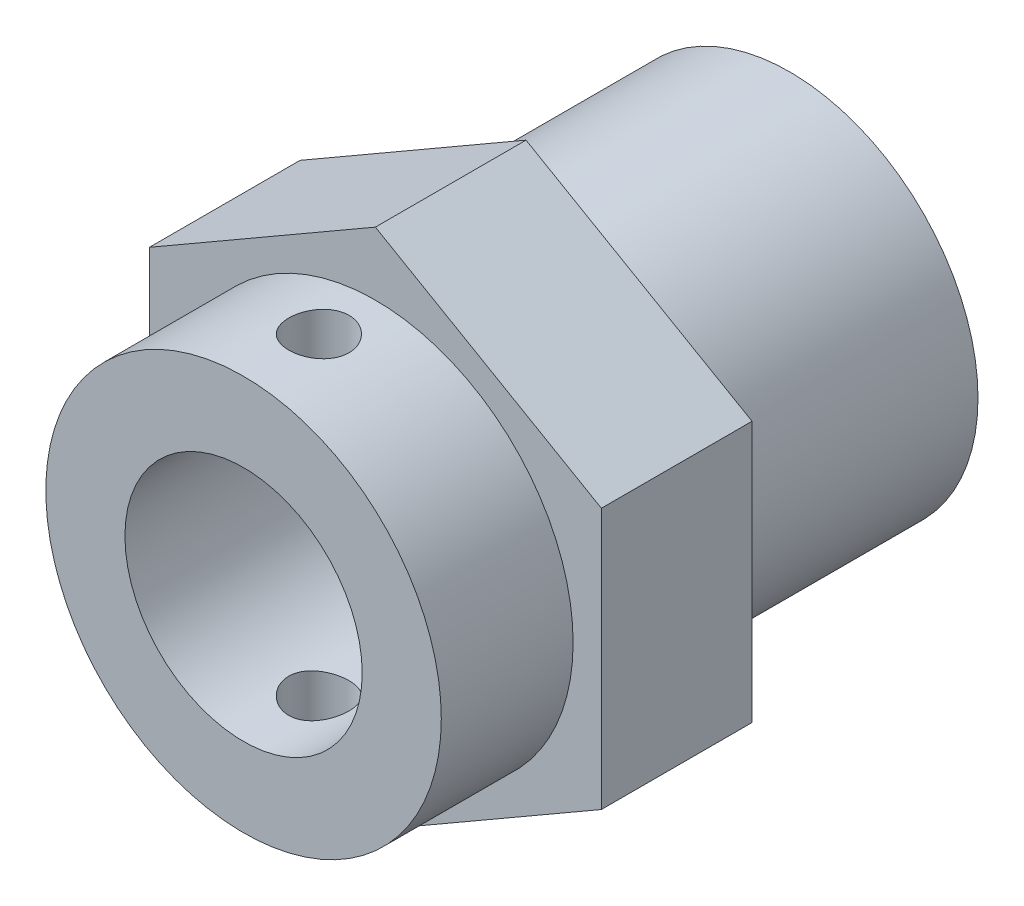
ISO-10303-21;
HEADER;
FILE_DESCRIPTION(('STEP AP214'),'2;1');
FILE_NAME('part.step','',(''),(''),'','','');
FILE_SCHEMA(('AUTOMOTIVE_DESIGN { 1 0 10303 214 1 1 1 1 }'));
ENDSEC;
DATA;
#1=APPLICATION_CONTEXT('core data for automotive mechanical design processes');
#2=APPLICATION_PROTOCOL_DEFINITION('international standard','automotive_design',2000,#1);
#3=PRODUCT_CONTEXT('',#1,'mechanical');
#4=PRODUCT('Part','Part','',(#3));
#5=PRODUCT_RELATED_PRODUCT_CATEGORY('part','',(#4));
#6=PRODUCT_DEFINITION_FORMATION('','',#4);
#7=PRODUCT_DEFINITION_CONTEXT('part definition',#1,'design');
#8=PRODUCT_DEFINITION('design','',#6,#7);
#9=PRODUCT_DEFINITION_SHAPE('','',#8);
#10=(LENGTH_UNIT() NAMED_UNIT(*) SI_UNIT(.MILLI.,.METRE.));
#11=(NAMED_UNIT(*) PLANE_ANGLE_UNIT() SI_UNIT($,.RADIAN.));
#12=(NAMED_UNIT(*) SI_UNIT($,.STERADIAN.) SOLID_ANGLE_UNIT());
#13=UNCERTAINTY_MEASURE_WITH_UNIT(LENGTH_MEASURE(1.E-05),#10,'distance_accuracy_value','');
#14=(GEOMETRIC_REPRESENTATION_CONTEXT(3) GLOBAL_UNCERTAINTY_ASSIGNED_CONTEXT((#13)) GLOBAL_UNIT_ASSIGNED_CONTEXT((#10,
#11,#12)) REPRESENTATION_CONTEXT('',''));
#15=CARTESIAN_POINT('',(0.,0.,0.));
#16=DIRECTION('',(0.,0.,1.));
#17=DIRECTION('',(1.,0.,0.));
#18=AXIS2_PLACEMENT_3D('',#15,#16,#17);
#19=CARTESIAN_POINT('',(0.,0.,3.));
#20=DIRECTION('',(0.,0.,-1.));
#21=DIRECTION('',(-1.,0.,0.));
#22=AXIS2_PLACEMENT_3D('',#19,#20,#21);
#23=CYLINDRICAL_SURFACE('',#22,3.15);
#24=CARTESIAN_POINT('',(0.,0.,3.));
#25=DIRECTION('',(0.,0.,-1.));
#26=DIRECTION('',(-1.,0.,0.));
#27=AXIS2_PLACEMENT_3D('',#24,#25,#26);
#28=CIRCLE('',#27,3.15);
#29=CARTESIAN_POINT('',(-3.15,0.,3.));
#30=VERTEX_POINT('',#29);
#31=EDGE_CURVE('E11',#30,#30,#28,.T.);
#32=ORIENTED_EDGE('',*,*,#31,.T.);
#33=EDGE_LOOP('',(#32));
#34=FACE_BOUND('',#33,.T.);
#35=CARTESIAN_POINT('',(0.,0.,-7.));
#36=DIRECTION('',(0.,0.,-1.));
#37=DIRECTION('',(-1.,0.,0.));
#38=AXIS2_PLACEMENT_3D('',#35,#36,#37);
#39=CIRCLE('',#38,3.15);
#40=CARTESIAN_POINT('',(-3.15,0.,-7.));
#41=VERTEX_POINT('',#40);
#42=EDGE_CURVE('E49',#41,#41,#39,.T.);
#43=ORIENTED_EDGE('',*,*,#42,.F.);
#44=EDGE_LOOP('',(#43));
#45=FACE_BOUND('',#44,.T.);
#46=ADVANCED_FACE('F46',(#34,#45),#23,.T.);
#47=CARTESIAN_POINT('',(0.,0.,3.));
#48=DIRECTION('',(0.,0.,-1.));
#49=DIRECTION('',(-1.,0.,0.));
#50=AXIS2_PLACEMENT_3D('',#47,#48,#49);
#51=PLANE('',#50);
#52=ORIENTED_EDGE('',*,*,#31,.F.);
#53=EDGE_LOOP('',(#52));
#54=FACE_BOUND('',#53,.T.);
#55=ADVANCED_FACE('F61',(#54),#51,.F.);
#56=CARTESIAN_POINT('',(0.,0.,-7.));
#57=DIRECTION('',(0.,0.,-1.));
#58=DIRECTION('',(-1.,0.,0.));
#59=AXIS2_PLACEMENT_3D('',#56,#57,#58);
#60=PLANE('',#59);
#61=ORIENTED_EDGE('',*,*,#42,.T.);
#62=EDGE_LOOP('',(#61));
#63=FACE_BOUND('',#62,.T.);
#64=ADVANCED_FACE('F58',(#63),#60,.T.);
#65=CLOSED_SHELL('',(#46,#55,#64));
#66=MANIFOLD_SOLID_BREP('B2',#65);
#67=CARTESIAN_POINT('',(0.,0.,4.));
#68=DIRECTION('',(0.,0.,1.));
#69=DIRECTION('',(1.,0.,0.));
#70=AXIS2_PLACEMENT_3D('',#67,#68,#69);
#71=PLANE('',#70);
#72=DIRECTION('',(0.,1.,0.));
#73=VECTOR('',#72,1.);
#74=CARTESIAN_POINT('',(6.,-3.46410161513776,4.));
#75=LINE('',#74,#73);
#76=CARTESIAN_POINT('',(6.,-3.46410161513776,4.));
#77=VERTEX_POINT('',#76);
#78=CARTESIAN_POINT('',(6.,3.46410161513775,4.));
#79=VERTEX_POINT('',#78);
#80=EDGE_CURVE('E189',#77,#79,#75,.T.);
#81=ORIENTED_EDGE('',*,*,#80,.T.);
#82=DIRECTION('',(-0.866025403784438,0.5,0.));
#83=VECTOR('',#82,1.);
#84=CARTESIAN_POINT('',(6.,3.46410161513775,4.));
#85=LINE('',#84,#83);
#86=CARTESIAN_POINT('',(0.,6.92820323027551,4.));
#87=VERTEX_POINT('',#86);
#88=EDGE_CURVE('E147',#79,#87,#85,.T.);
#89=ORIENTED_EDGE('',*,*,#88,.T.);
#90=DIRECTION('',(-0.866025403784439,-0.5,0.));
#91=VECTOR('',#90,1.);
#92=CARTESIAN_POINT('',(0.,6.92820323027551,4.));
#93=LINE('',#92,#91);
#94=CARTESIAN_POINT('',(-6.,3.46410161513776,4.));
#95=VERTEX_POINT('',#94);
#96=EDGE_CURVE('E160',#87,#95,#93,.T.);
#97=ORIENTED_EDGE('',*,*,#96,.T.);
#98=DIRECTION('',(0.,-1.,0.));
#99=VECTOR('',#98,1.);
#100=CARTESIAN_POINT('',(-6.,3.46410161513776,4.));
#101=LINE('',#100,#99);
#102=CARTESIAN_POINT('',(-6.,-3.46410161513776,4.));
#103=VERTEX_POINT('',#102);
#104=EDGE_CURVE('E154',#95,#103,#101,.T.);
#105=ORIENTED_EDGE('',*,*,#104,.T.);
#106=DIRECTION('',(0.866025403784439,-0.5,0.));
#107=VECTOR('',#106,1.);
#108=CARTESIAN_POINT('',(-6.,-3.46410161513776,4.));
#109=LINE('',#108,#107);
#110=CARTESIAN_POINT('',(0.,-6.92820323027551,4.));
#111=VERTEX_POINT('',#110);
#112=EDGE_CURVE('E158',#103,#111,#109,.T.);
#113=ORIENTED_EDGE('',*,*,#112,.T.);
#114=DIRECTION('',(0.866025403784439,0.5,0.));
#115=VECTOR('',#114,1.);
#116=CARTESIAN_POINT('',(0.,-6.92820323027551,4.));
#117=LINE('',#116,#115);
#118=EDGE_CURVE('E109',#111,#77,#117,.T.);
#119=ORIENTED_EDGE('',*,*,#118,.T.);
#120=EDGE_LOOP('',(#81,#89,#97,#105,#113,#119));
#121=FACE_BOUND('',#120,.T.);
#122=CARTESIAN_POINT('',(0.,0.,4.));
#123=DIRECTION('',(0.,0.,1.));
#124=DIRECTION('',(1.,0.,0.));
#125=AXIS2_PLACEMENT_3D('',#122,#123,#124);
#126=CIRCLE('',#125,5.25);
#127=CARTESIAN_POINT('',(5.25,0.,4.));
#128=VERTEX_POINT('',#127);
#129=EDGE_CURVE('E277',#128,#128,#126,.T.);
#130=ORIENTED_EDGE('',*,*,#129,.F.);
#131=EDGE_LOOP('',(#130));
#132=FACE_BOUND('',#131,.T.);
#133=ADVANCED_FACE('F86',(#121,#132),#71,.T.);
#134=CARTESIAN_POINT('',(0.,0.,-7.));
#135=DIRECTION('',(0.,0.,1.));
#136=DIRECTION('',(1.,0.,0.));
#137=AXIS2_PLACEMENT_3D('',#134,#135,#136);
#138=CYLINDRICAL_SURFACE('',#137,5.);
#139=CARTESIAN_POINT('',(0.,0.,-7.));
#140=DIRECTION('',(0.,0.,1.));
#141=DIRECTION('',(1.,0.,0.));
#142=AXIS2_PLACEMENT_3D('',#139,#140,#141);
#143=CIRCLE('',#142,5.);
#144=CARTESIAN_POINT('',(5.,0.,-7.));
#145=VERTEX_POINT('',#144);
#146=EDGE_CURVE('E44',#145,#145,#143,.T.);
#147=ORIENTED_EDGE('',*,*,#146,.T.);
#148=EDGE_LOOP('',(#147));
#149=FACE_BOUND('',#148,.T.);
#150=CARTESIAN_POINT('',(0.,0.,0.));
#151=DIRECTION('',(0.,0.,1.));
#152=DIRECTION('',(1.,0.,0.));
#153=AXIS2_PLACEMENT_3D('',#150,#151,#152);
#154=CIRCLE('',#153,5.);
#155=CARTESIAN_POINT('',(5.,0.,0.));
#156=VERTEX_POINT('',#155);
#157=EDGE_CURVE('E100',#156,#156,#154,.T.);
#158=ORIENTED_EDGE('',*,*,#157,.F.);
#159=EDGE_LOOP('',(#158));
#160=FACE_BOUND('',#159,.T.);
#161=ADVANCED_FACE('F88',(#149,#160),#138,.T.);
#162=CARTESIAN_POINT('',(0.,0.,-7.));
#163=DIRECTION('',(0.,0.,1.));
#164=DIRECTION('',(1.,0.,0.));
#165=AXIS2_PLACEMENT_3D('',#162,#163,#164);
#166=PLANE('',#165);
#167=CARTESIAN_POINT('',(0.,0.,-7.));
#168=DIRECTION('',(0.,0.,1.));
#169=DIRECTION('',(1.,0.,0.));
#170=AXIS2_PLACEMENT_3D('',#167,#168,#169);
#171=CIRCLE('',#170,3.15);
#172=CARTESIAN_POINT('',(3.15,0.,-7.));
#173=VERTEX_POINT('',#172);
#174=EDGE_CURVE('E265',#173,#173,#171,.T.);
#175=ORIENTED_EDGE('',*,*,#174,.T.);
#176=EDGE_LOOP('',(#175));
#177=FACE_BOUND('',#176,.T.);
#178=ORIENTED_EDGE('',*,*,#146,.F.);
#179=EDGE_LOOP('',(#178));
#180=FACE_BOUND('',#179,.T.);
#181=ADVANCED_FACE('F254',(#177,#180),#166,.F.);
#182=CARTESIAN_POINT('',(6.,-3.46410161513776,4.));
#183=DIRECTION('',(-1.,0.,0.));
#184=DIRECTION('',(0.,-1.,0.));
#185=AXIS2_PLACEMENT_3D('',#182,#183,#184);
#186=PLANE('',#185);
#187=DIRECTION('',(0.,1.,0.));
#188=VECTOR('',#187,1.);
#189=CARTESIAN_POINT('',(6.,-3.46410161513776,0.));
#190=LINE('',#189,#188);
#191=CARTESIAN_POINT('',(6.,-3.46410161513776,0.));
#192=VERTEX_POINT('',#191);
#193=CARTESIAN_POINT('',(6.,3.46410161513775,0.));
#194=VERTEX_POINT('',#193);
#195=EDGE_CURVE('E178',#192,#194,#190,.T.);
#196=ORIENTED_EDGE('',*,*,#195,.T.);
#197=DIRECTION('',(0.,0.,-1.));
#198=VECTOR('',#197,1.);
#199=CARTESIAN_POINT('',(6.,3.46410161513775,4.));
#200=LINE('',#199,#198);
#201=EDGE_CURVE('E196',#79,#194,#200,.T.);
#202=ORIENTED_EDGE('',*,*,#201,.F.);
#203=ORIENTED_EDGE('',*,*,#80,.F.);
#204=DIRECTION('',(0.,0.,-1.));
#205=VECTOR('',#204,1.);
#206=CARTESIAN_POINT('',(6.,-3.46410161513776,4.));
#207=LINE('',#206,#205);
#208=EDGE_CURVE('E174',#77,#192,#207,.T.);
#209=ORIENTED_EDGE('',*,*,#208,.T.);
#210=EDGE_LOOP('',(#196,#202,#203,#209));
#211=FACE_BOUND('',#210,.T.);
#212=ADVANCED_FACE('F252',(#211),#186,.F.);
#213=CARTESIAN_POINT('',(6.,3.46410161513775,4.));
#214=DIRECTION('',(-0.5,-0.866025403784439,0.));
#215=DIRECTION('',(0.866025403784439,-0.5,0.));
#216=AXIS2_PLACEMENT_3D('',#213,#214,#215);
#217=PLANE('',#216);
#218=DIRECTION('',(-0.866025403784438,0.5,0.));
#219=VECTOR('',#218,1.);
#220=CARTESIAN_POINT('',(6.,3.46410161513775,0.));
#221=LINE('',#220,#219);
#222=CARTESIAN_POINT('',(0.,6.92820323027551,0.));
#223=VERTEX_POINT('',#222);
#224=EDGE_CURVE('E181',#194,#223,#221,.T.);
#225=ORIENTED_EDGE('',*,*,#224,.T.);
#226=DIRECTION('',(0.,0.,-1.));
#227=VECTOR('',#226,1.);
#228=CARTESIAN_POINT('',(0.,6.92820323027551,4.));
#229=LINE('',#228,#227);
#230=EDGE_CURVE('E193',#87,#223,#229,.T.);
#231=ORIENTED_EDGE('',*,*,#230,.F.);
#232=ORIENTED_EDGE('',*,*,#88,.F.);
#233=ORIENTED_EDGE('',*,*,#201,.T.);
#234=EDGE_LOOP('',(#225,#231,#232,#233));
#235=FACE_BOUND('',#234,.T.);
#236=ADVANCED_FACE('F248',(#235),#217,.F.);
#237=CARTESIAN_POINT('',(0.,6.92820323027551,4.));
#238=DIRECTION('',(0.5,-0.866025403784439,0.));
#239=DIRECTION('',(0.866025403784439,0.5,0.));
#240=AXIS2_PLACEMENT_3D('',#237,#238,#239);
#241=PLANE('',#240);
#242=DIRECTION('',(-0.866025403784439,-0.5,0.));
#243=VECTOR('',#242,1.);
#244=CARTESIAN_POINT('',(0.,6.92820323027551,0.));
#245=LINE('',#244,#243);
#246=CARTESIAN_POINT('',(-6.,3.46410161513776,0.));
#247=VERTEX_POINT('',#246);
#248=EDGE_CURVE('E184',#223,#247,#245,.T.);
#249=ORIENTED_EDGE('',*,*,#248,.T.);
#250=DIRECTION('',(0.,0.,-1.));
#251=VECTOR('',#250,1.);
#252=CARTESIAN_POINT('',(-6.,3.46410161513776,4.));
#253=LINE('',#252,#251);
#254=EDGE_CURVE('E169',#95,#247,#253,.T.);
#255=ORIENTED_EDGE('',*,*,#254,.F.);
#256=ORIENTED_EDGE('',*,*,#96,.F.);
#257=ORIENTED_EDGE('',*,*,#230,.T.);
#258=EDGE_LOOP('',(#249,#255,#256,#257));
#259=FACE_BOUND('',#258,.T.);
#260=ADVANCED_FACE('F245',(#259),#241,.F.);
#261=CARTESIAN_POINT('',(-6.,3.46410161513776,4.));
#262=DIRECTION('',(1.,0.,0.));
#263=DIRECTION('',(0.,0.,-1.));
#264=AXIS2_PLACEMENT_3D('',#261,#262,#263);
#265=PLANE('',#264);
#266=DIRECTION('',(0.,-1.,0.));
#267=VECTOR('',#266,1.);
#268=CARTESIAN_POINT('',(-6.,3.46410161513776,0.));
#269=LINE('',#268,#267);
#270=CARTESIAN_POINT('',(-6.,-3.46410161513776,0.));
#271=VERTEX_POINT('',#270);
#272=EDGE_CURVE('E168',#247,#271,#269,.T.);
#273=ORIENTED_EDGE('',*,*,#272,.T.);
#274=DIRECTION('',(0.,0.,-1.));
#275=VECTOR('',#274,1.);
#276=CARTESIAN_POINT('',(-6.,-3.46410161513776,4.));
#277=LINE('',#276,#275);
#278=EDGE_CURVE('E165',#103,#271,#277,.T.);
#279=ORIENTED_EDGE('',*,*,#278,.F.);
#280=ORIENTED_EDGE('',*,*,#104,.F.);
#281=ORIENTED_EDGE('',*,*,#254,.T.);
#282=EDGE_LOOP('',(#273,#279,#280,#281));
#283=FACE_BOUND('',#282,.T.);
#284=ADVANCED_FACE('F166',(#283),#265,.F.);
#285=CARTESIAN_POINT('',(-6.,-3.46410161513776,4.));
#286=DIRECTION('',(0.5,0.866025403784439,0.));
#287=DIRECTION('',(-0.866025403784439,0.5,0.));
#288=AXIS2_PLACEMENT_3D('',#285,#286,#287);
#289=PLANE('',#288);
#290=DIRECTION('',(0.866025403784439,-0.5,0.));
#291=VECTOR('',#290,1.);
#292=CARTESIAN_POINT('',(-6.,-3.46410161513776,0.));
#293=LINE('',#292,#291);
#294=CARTESIAN_POINT('',(0.,-6.92820323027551,0.));
#295=VERTEX_POINT('',#294);
#296=EDGE_CURVE('E132',#271,#295,#293,.T.);
#297=ORIENTED_EDGE('',*,*,#296,.T.);
#298=DIRECTION('',(0.,0.,-1.));
#299=VECTOR('',#298,1.);
#300=CARTESIAN_POINT('',(0.,-6.92820323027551,4.));
#301=LINE('',#300,#299);
#302=EDGE_CURVE('E170',#111,#295,#301,.T.);
#303=ORIENTED_EDGE('',*,*,#302,.F.);
#304=ORIENTED_EDGE('',*,*,#112,.F.);
#305=ORIENTED_EDGE('',*,*,#278,.T.);
#306=EDGE_LOOP('',(#297,#303,#304,#305));
#307=FACE_BOUND('',#306,.T.);
#308=ADVANCED_FACE('F172',(#307),#289,.F.);
#309=CARTESIAN_POINT('',(0.,-6.92820323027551,4.));
#310=DIRECTION('',(-0.5,0.866025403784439,0.));
#311=DIRECTION('',(-0.866025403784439,-0.5,0.));
#312=AXIS2_PLACEMENT_3D('',#309,#310,#311);
#313=PLANE('',#312);
#314=DIRECTION('',(0.866025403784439,0.5,0.));
#315=VECTOR('',#314,1.);
#316=CARTESIAN_POINT('',(0.,-6.92820323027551,0.));
#317=LINE('',#316,#315);
#318=EDGE_CURVE('E138',#295,#192,#317,.T.);
#319=ORIENTED_EDGE('',*,*,#318,.T.);
#320=ORIENTED_EDGE('',*,*,#208,.F.);
#321=ORIENTED_EDGE('',*,*,#118,.F.);
#322=ORIENTED_EDGE('',*,*,#302,.T.);
#323=EDGE_LOOP('',(#319,#320,#321,#322));
#324=FACE_BOUND('',#323,.T.);
#325=ADVANCED_FACE('F237',(#324),#313,.F.);
#326=CARTESIAN_POINT('',(0.,0.,0.));
#327=DIRECTION('',(0.,0.,1.));
#328=DIRECTION('',(1.,0.,0.));
#329=AXIS2_PLACEMENT_3D('',#326,#327,#328);
#330=PLANE('',#329);
#331=ORIENTED_EDGE('',*,*,#157,.T.);
#332=EDGE_LOOP('',(#331));
#333=FACE_BOUND('',#332,.T.);
#334=ORIENTED_EDGE('',*,*,#195,.F.);
#335=ORIENTED_EDGE('',*,*,#318,.F.);
#336=ORIENTED_EDGE('',*,*,#296,.F.);
#337=ORIENTED_EDGE('',*,*,#272,.F.);
#338=ORIENTED_EDGE('',*,*,#248,.F.);
#339=ORIENTED_EDGE('',*,*,#224,.F.);
#340=EDGE_LOOP('',(#334,#335,#336,#337,#338,#339));
#341=FACE_BOUND('',#340,.T.);
#342=ADVANCED_FACE('F230',(#333,#341),#330,.F.);
#343=CARTESIAN_POINT('',(0.,0.,7.5));
#344=DIRECTION('',(0.,0.,-1.));
#345=DIRECTION('',(-1.,0.,0.));
#346=AXIS2_PLACEMENT_3D('',#343,#344,#345);
#347=CYLINDRICAL_SURFACE('',#346,5.25);
#348=CARTESIAN_POINT('',(0.,-5.25,6.3));
#349=CARTESIAN_POINT('',(0.0446589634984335,-5.24999927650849,6.29999816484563));
#350=CARTESIAN_POINT('',(0.0893436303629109,-5.24942419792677,6.29624783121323));
#351=CARTESIAN_POINT('',(0.177463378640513,-5.24718544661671,6.28134971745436));
#352=CARTESIAN_POINT('',(0.220897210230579,-5.2455207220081,6.27019478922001));
#353=CARTESIAN_POINT('',(0.305227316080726,-5.2412897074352,6.24082903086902));
#354=CARTESIAN_POINT('',(0.346125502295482,-5.2387241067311,6.22262359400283));
#355=CARTESIAN_POINT('',(0.424280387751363,-5.23297464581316,6.17968691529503));
#356=CARTESIAN_POINT('',(0.461537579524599,-5.22979086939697,6.15495655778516));
#357=CARTESIAN_POINT('',(0.531658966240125,-5.22313028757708,6.09945992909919));
#358=CARTESIAN_POINT('',(0.564489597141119,-5.21965153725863,6.06865147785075));
#359=CARTESIAN_POINT('',(0.624536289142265,-5.21280826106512,6.00196397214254));
#360=CARTESIAN_POINT('',(0.651752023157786,-5.20944374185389,5.96608462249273));
#361=CARTESIAN_POINT('',(0.699927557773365,-5.2031910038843,5.8900475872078));
#362=CARTESIAN_POINT('',(0.720854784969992,-5.20030529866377,5.84986903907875));
#363=CARTESIAN_POINT('',(0.755651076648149,-5.19536353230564,5.76651593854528));
#364=CARTESIAN_POINT('',(0.769520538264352,-5.19330742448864,5.72334155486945));
#365=CARTESIAN_POINT('',(0.789703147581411,-5.19027680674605,5.63557573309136));
#366=CARTESIAN_POINT('',(0.7960738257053,-5.18929406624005,5.59099781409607));
#367=CARTESIAN_POINT('',(0.801256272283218,-5.18849647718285,5.50139568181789));
#368=CARTESIAN_POINT('',(0.800068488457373,-5.18868155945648,5.4563714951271));
#369=CARTESIAN_POINT('',(0.790214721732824,-5.19019117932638,5.36756188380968));
#370=CARTESIAN_POINT('',(0.781612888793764,-5.19150594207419,5.32376915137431));
#371=CARTESIAN_POINT('',(0.757275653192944,-5.19511150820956,5.2382559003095));
#372=CARTESIAN_POINT('',(0.741540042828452,-5.19740234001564,5.19653544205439));
#373=CARTESIAN_POINT('',(0.703315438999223,-5.20271268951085,5.11615627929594));
#374=CARTESIAN_POINT('',(0.68079934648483,-5.20573512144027,5.07751066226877));
#375=CARTESIAN_POINT('',(0.629672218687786,-5.21216602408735,5.0045218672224));
#376=CARTESIAN_POINT('',(0.601060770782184,-5.21557452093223,4.97017898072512));
#377=CARTESIAN_POINT('',(0.538203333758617,-5.22243665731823,4.90639878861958));
#378=CARTESIAN_POINT('',(0.503902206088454,-5.2258903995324,4.87701580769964));
#379=CARTESIAN_POINT('',(0.430826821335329,-5.23242120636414,4.82441511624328));
#380=CARTESIAN_POINT('',(0.392052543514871,-5.2354982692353,4.80119743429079));
#381=CARTESIAN_POINT('',(0.311083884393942,-5.24093238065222,4.76158331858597));
#382=CARTESIAN_POINT('',(0.26888737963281,-5.2432889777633,4.74519115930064));
#383=CARTESIAN_POINT('',(0.182296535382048,-5.24701288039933,4.71974106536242));
#384=CARTESIAN_POINT('',(0.137902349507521,-5.24838025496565,4.71068261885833));
#385=CARTESIAN_POINT('',(0.0486451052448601,-5.24996248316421,4.70022951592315));
#386=CARTESIAN_POINT('',(0.00379098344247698,-5.25018856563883,4.6987601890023));
#387=CARTESIAN_POINT('',(-0.0855230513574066,-5.24949332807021,4.70332871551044));
#388=CARTESIAN_POINT('',(-0.129982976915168,-5.24857204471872,4.70936632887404));
#389=CARTESIAN_POINT('',(-0.217019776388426,-5.24569253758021,4.72871525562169));
#390=CARTESIAN_POINT('',(-0.259604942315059,-5.24373951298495,4.74199010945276));
#391=CARTESIAN_POINT('',(-0.341945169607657,-5.2390147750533,4.77539818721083));
#392=CARTESIAN_POINT('',(-0.381700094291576,-5.23624302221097,4.79553174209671));
#393=CARTESIAN_POINT('',(-0.457579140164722,-5.23016087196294,4.84226031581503));
#394=CARTESIAN_POINT('',(-0.493673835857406,-5.22684659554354,4.86890260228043));
#395=CARTESIAN_POINT('',(-0.560906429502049,-5.22006014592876,4.9278266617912));
#396=CARTESIAN_POINT('',(-0.592044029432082,-5.21658796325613,4.96010877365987));
#397=CARTESIAN_POINT('',(-0.648750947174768,-5.20984133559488,5.02972887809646));
#398=CARTESIAN_POINT('',(-0.674270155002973,-5.2065688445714,5.06710790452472));
#399=CARTESIAN_POINT('',(-0.718667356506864,-5.20062698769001,5.1456658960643));
#400=CARTESIAN_POINT('',(-0.737545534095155,-5.19795760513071,5.18684475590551));
#401=CARTESIAN_POINT('',(-0.768047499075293,-5.19353841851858,5.2716853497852));
#402=CARTESIAN_POINT('',(-0.779697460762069,-5.19178530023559,5.31533749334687));
#403=CARTESIAN_POINT('',(-0.795495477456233,-5.18938839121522,5.4040075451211));
#404=CARTESIAN_POINT('',(-0.799644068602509,-5.18874452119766,5.4490253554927));
#405=CARTESIAN_POINT('',(-0.800308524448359,-5.18864203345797,5.53864926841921));
#406=CARTESIAN_POINT('',(-0.796903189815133,-5.1891711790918,5.58325479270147));
#407=CARTESIAN_POINT('',(-0.782725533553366,-5.19132847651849,5.67125079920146));
#408=CARTESIAN_POINT('',(-0.771953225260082,-5.192956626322,5.71464128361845));
#409=CARTESIAN_POINT('',(-0.743375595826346,-5.19712415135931,5.79895249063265));
#410=CARTESIAN_POINT('',(-0.725575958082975,-5.1996627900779,5.8398751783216));
#411=CARTESIAN_POINT('',(-0.683456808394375,-5.2053661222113,5.9181661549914));
#412=CARTESIAN_POINT('',(-0.659137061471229,-5.20853083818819,5.95553431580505));
#413=CARTESIAN_POINT('',(-0.604382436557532,-5.21516900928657,6.02605555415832));
#414=CARTESIAN_POINT('',(-0.573889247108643,-5.21864521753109,6.05916310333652));
#415=CARTESIAN_POINT('',(-0.507776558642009,-5.22549184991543,6.11981912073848));
#416=CARTESIAN_POINT('',(-0.472155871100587,-5.22886224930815,6.1473662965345));
#417=CARTESIAN_POINT('',(-0.396560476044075,-5.23513946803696,6.19626013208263));
#418=CARTESIAN_POINT('',(-0.356562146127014,-5.23804354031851,6.21757061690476));
#419=CARTESIAN_POINT('',(-0.273528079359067,-5.24303399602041,6.25313884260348));
#420=CARTESIAN_POINT('',(-0.230495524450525,-5.2451212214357,6.26740384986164));
#421=CARTESIAN_POINT('',(-0.156061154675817,-5.24776922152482,6.28525905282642));
#422=CARTESIAN_POINT('',(-0.125117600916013,-5.24860144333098,6.29077840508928));
#423=CARTESIAN_POINT('',(-0.062786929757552,-5.24971708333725,6.29814949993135));
#424=CARTESIAN_POINT('',(-0.0313998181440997,-5.25000050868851,6.30000129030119));
#425=CARTESIAN_POINT('',(0.,-5.25,6.3));
#426=B_SPLINE_CURVE_WITH_KNOTS('',3,(#348,#349,#350,#351,#352,#353,#354,#355,#356,#357,#358,
#359,#360,#361,#362,#363,#364,#365,#366,#367,#368,#369,#370,#371,#372,#373,#374,#375,#376,#377,
#378,#379,#380,#381,#382,#383,#384,#385,#386,#387,#388,#389,#390,#391,#392,#393,#394,#395,#396,
#397,#398,#399,#400,#401,#402,#403,#404,#405,#406,#407,#408,#409,#410,#411,#412,#413,#414,#415,
#416,#417,#418,#419,#420,#421,#422,#423,#424,#425),.UNSPECIFIED.,.T.,.F.,(4,2,2,2,2,2,2,2,2,2,2,
2,2,2,2,2,2,2,2,2,2,2,2,2,2,2,2,2,2,2,2,2,2,2,2,2,2,2,4),(0.,0.133862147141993,
0.267853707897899,0.401742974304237,0.535614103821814,0.67044918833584,0.805292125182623,
0.940821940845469,1.07634412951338,1.21081967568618,1.34528725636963,1.4786029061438,
1.61192243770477,1.74578203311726,1.87965069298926,2.0149018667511,2.15015366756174,
2.28549004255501,2.420816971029,2.55480982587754,2.68879839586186,2.82211811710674,
2.95544427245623,3.08976905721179,3.22410191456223,3.35958826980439,3.49507087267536,
3.63005996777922,3.76503941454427,3.89861741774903,4.03219517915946,4.1656651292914,
4.29913989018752,4.43393972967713,4.56877086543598,4.70436923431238,4.83982745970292,
4.93394746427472,5.02806624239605),.UNSPECIFIED.);
#427=CARTESIAN_POINT('',(0.,-5.25,6.3));
#428=VERTEX_POINT('',#427);
#429=EDGE_CURVE('E216',#428,#428,#426,.T.);
#430=ORIENTED_EDGE('',*,*,#429,.T.);
#431=EDGE_LOOP('',(#430));
#432=FACE_BOUND('',#431,.T.);
#433=CARTESIAN_POINT('',(0.,5.25,6.3));
#434=CARTESIAN_POINT('',(-0.0446589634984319,5.24999927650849,6.29999816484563));
#435=CARTESIAN_POINT('',(-0.0893436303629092,5.24942419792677,6.29624783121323));
#436=CARTESIAN_POINT('',(-0.177463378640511,5.24718544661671,6.28134971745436));
#437=CARTESIAN_POINT('',(-0.220897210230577,5.2455207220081,6.27019478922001));
#438=CARTESIAN_POINT('',(-0.305227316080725,5.2412897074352,6.24082903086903));
#439=CARTESIAN_POINT('',(-0.346125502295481,5.2387241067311,6.22262359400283));
#440=CARTESIAN_POINT('',(-0.424280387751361,5.23297464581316,6.17968691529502));
#441=CARTESIAN_POINT('',(-0.461537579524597,5.22979086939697,6.15495655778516));
#442=CARTESIAN_POINT('',(-0.531658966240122,5.22313028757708,6.09945992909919));
#443=CARTESIAN_POINT('',(-0.564489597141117,5.21965153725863,6.06865147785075));
#444=CARTESIAN_POINT('',(-0.624536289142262,5.21280826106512,6.00196397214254));
#445=CARTESIAN_POINT('',(-0.651752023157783,5.20944374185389,5.96608462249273));
#446=CARTESIAN_POINT('',(-0.699927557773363,5.2031910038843,5.8900475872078));
#447=CARTESIAN_POINT('',(-0.720854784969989,5.20030529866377,5.84986903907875));
#448=CARTESIAN_POINT('',(-0.755651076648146,5.19536353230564,5.76651593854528));
#449=CARTESIAN_POINT('',(-0.769520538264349,5.19330742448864,5.72334155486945));
#450=CARTESIAN_POINT('',(-0.789703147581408,5.19027680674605,5.63557573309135));
#451=CARTESIAN_POINT('',(-0.796073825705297,5.18929406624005,5.59099781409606));
#452=CARTESIAN_POINT('',(-0.801256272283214,5.18849647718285,5.50139568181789));
#453=CARTESIAN_POINT('',(-0.800068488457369,5.18868155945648,5.4563714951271));
#454=CARTESIAN_POINT('',(-0.790214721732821,5.19019117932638,5.36756188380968));
#455=CARTESIAN_POINT('',(-0.781612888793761,5.19150594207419,5.32376915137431));
#456=CARTESIAN_POINT('',(-0.75727565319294,5.19511150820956,5.2382559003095));
#457=CARTESIAN_POINT('',(-0.741540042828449,5.19740234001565,5.19653544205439));
#458=CARTESIAN_POINT('',(-0.703315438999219,5.20271268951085,5.11615627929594));
#459=CARTESIAN_POINT('',(-0.680799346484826,5.20573512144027,5.07751066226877));
#460=CARTESIAN_POINT('',(-0.629672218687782,5.21216602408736,5.0045218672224));
#461=CARTESIAN_POINT('',(-0.60106077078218,5.21557452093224,4.97017898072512));
#462=CARTESIAN_POINT('',(-0.538203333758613,5.22243665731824,4.90639878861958));
#463=CARTESIAN_POINT('',(-0.503902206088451,5.2258903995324,4.87701580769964));
#464=CARTESIAN_POINT('',(-0.430826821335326,5.23242120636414,4.82441511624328));
#465=CARTESIAN_POINT('',(-0.392052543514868,5.2354982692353,4.80119743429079));
#466=CARTESIAN_POINT('',(-0.311083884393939,5.24093238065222,4.76158331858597));
#467=CARTESIAN_POINT('',(-0.268887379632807,5.2432889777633,4.74519115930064));
#468=CARTESIAN_POINT('',(-0.182296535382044,5.24701288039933,4.71974106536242));
#469=CARTESIAN_POINT('',(-0.137902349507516,5.24838025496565,4.71068261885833));
#470=CARTESIAN_POINT('',(-0.0486451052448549,5.24996248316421,4.70022951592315));
#471=CARTESIAN_POINT('',(-0.00379098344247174,5.25018856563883,4.6987601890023));
#472=CARTESIAN_POINT('',(0.0855230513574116,5.24949332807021,4.70332871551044));
#473=CARTESIAN_POINT('',(0.129982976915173,5.24857204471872,4.70936632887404));
#474=CARTESIAN_POINT('',(0.21701977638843,5.24569253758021,4.72871525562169));
#475=CARTESIAN_POINT('',(0.259604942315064,5.24373951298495,4.74199010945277));
#476=CARTESIAN_POINT('',(0.341945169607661,5.2390147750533,4.77539818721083));
#477=CARTESIAN_POINT('',(0.381700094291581,5.23624302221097,4.79553174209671));
#478=CARTESIAN_POINT('',(0.457579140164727,5.23016087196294,4.84226031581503));
#479=CARTESIAN_POINT('',(0.493673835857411,5.22684659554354,4.86890260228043));
#480=CARTESIAN_POINT('',(0.560906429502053,5.22006014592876,4.9278266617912));
#481=CARTESIAN_POINT('',(0.592044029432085,5.21658796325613,4.96010877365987));
#482=CARTESIAN_POINT('',(0.648750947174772,5.20984133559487,5.02972887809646));
#483=CARTESIAN_POINT('',(0.674270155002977,5.2065688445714,5.06710790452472));
#484=CARTESIAN_POINT('',(0.718667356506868,5.20062698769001,5.1456658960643));
#485=CARTESIAN_POINT('',(0.737545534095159,5.19795760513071,5.18684475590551));
#486=CARTESIAN_POINT('',(0.768047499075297,5.19353841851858,5.2716853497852));
#487=CARTESIAN_POINT('',(0.779697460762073,5.19178530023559,5.31533749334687));
#488=CARTESIAN_POINT('',(0.795495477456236,5.18938839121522,5.4040075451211));
#489=CARTESIAN_POINT('',(0.799644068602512,5.18874452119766,5.4490253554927));
#490=CARTESIAN_POINT('',(0.800308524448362,5.18864203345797,5.53864926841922));
#491=CARTESIAN_POINT('',(0.796903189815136,5.1891711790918,5.58325479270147));
#492=CARTESIAN_POINT('',(0.782725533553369,5.19132847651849,5.67125079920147));
#493=CARTESIAN_POINT('',(0.771953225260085,5.192956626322,5.71464128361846));
#494=CARTESIAN_POINT('',(0.743375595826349,5.19712415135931,5.79895249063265));
#495=CARTESIAN_POINT('',(0.725575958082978,5.1996627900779,5.8398751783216));
#496=CARTESIAN_POINT('',(0.683456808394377,5.2053661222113,5.9181661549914));
#497=CARTESIAN_POINT('',(0.659137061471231,5.20853083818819,5.95553431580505));
#498=CARTESIAN_POINT('',(0.604382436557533,5.21516900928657,6.02605555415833));
#499=CARTESIAN_POINT('',(0.573889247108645,5.21864521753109,6.05916310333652));
#500=CARTESIAN_POINT('',(0.507776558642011,5.22549184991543,6.11981912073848));
#501=CARTESIAN_POINT('',(0.472155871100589,5.22886224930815,6.1473662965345));
#502=CARTESIAN_POINT('',(0.396560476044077,5.23513946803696,6.19626013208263));
#503=CARTESIAN_POINT('',(0.356562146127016,5.2380435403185,6.21757061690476));
#504=CARTESIAN_POINT('',(0.273528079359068,5.24303399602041,6.25313884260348));
#505=CARTESIAN_POINT('',(0.230495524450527,5.2451212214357,6.26740384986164));
#506=CARTESIAN_POINT('',(0.156061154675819,5.24776922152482,6.28525905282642));
#507=CARTESIAN_POINT('',(0.125117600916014,5.24860144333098,6.29077840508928));
#508=CARTESIAN_POINT('',(0.0627869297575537,5.24971708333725,6.29814949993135));
#509=CARTESIAN_POINT('',(0.0313998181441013,5.25000050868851,6.30000129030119));
#510=CARTESIAN_POINT('',(0.,5.25,6.3));
#511=B_SPLINE_CURVE_WITH_KNOTS('',3,(#433,#434,#435,#436,#437,#438,#439,#440,#441,#442,#443,
#444,#445,#446,#447,#448,#449,#450,#451,#452,#453,#454,#455,#456,#457,#458,#459,#460,#461,#462,
#463,#464,#465,#466,#467,#468,#469,#470,#471,#472,#473,#474,#475,#476,#477,#478,#479,#480,#481,
#482,#483,#484,#485,#486,#487,#488,#489,#490,#491,#492,#493,#494,#495,#496,#497,#498,#499,#500,
#501,#502,#503,#504,#505,#506,#507,#508,#509,#510),.UNSPECIFIED.,.T.,.F.,(4,2,2,2,2,2,2,2,2,2,2,
2,2,2,2,2,2,2,2,2,2,2,2,2,2,2,2,2,2,2,2,2,2,2,2,2,2,2,4),(0.,0.133862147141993,
0.267853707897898,0.401742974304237,0.535614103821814,0.670449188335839,0.805292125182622,
0.940821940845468,1.07634412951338,1.21081967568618,1.34528725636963,1.4786029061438,
1.61192243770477,1.74578203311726,1.87965069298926,2.0149018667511,2.15015366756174,
2.28549004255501,2.420816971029,2.55480982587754,2.68879839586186,2.82211811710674,
2.95544427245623,3.08976905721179,3.22410191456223,3.35958826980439,3.49507087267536,
3.63005996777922,3.76503941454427,3.89861741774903,4.03219517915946,4.1656651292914,
4.29913989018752,4.43393972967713,4.56877086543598,4.70436923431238,4.83982745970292,
4.93394746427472,5.02806624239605),.UNSPECIFIED.);
#512=CARTESIAN_POINT('',(0.,5.25,6.3));
#513=VERTEX_POINT('',#512);
#514=EDGE_CURVE('E221',#513,#513,#511,.T.);
#515=ORIENTED_EDGE('',*,*,#514,.T.);
#516=EDGE_LOOP('',(#515));
#517=FACE_BOUND('',#516,.T.);
#518=CARTESIAN_POINT('',(0.,0.,7.5));
#519=DIRECTION('',(0.,0.,1.));
#520=DIRECTION('',(1.,0.,0.));
#521=AXIS2_PLACEMENT_3D('',#518,#519,#520);
#522=CIRCLE('',#521,5.25);
#523=CARTESIAN_POINT('',(5.25,0.,7.5));
#524=VERTEX_POINT('',#523);
#525=EDGE_CURVE('E182',#524,#524,#522,.T.);
#526=ORIENTED_EDGE('',*,*,#525,.F.);
#527=EDGE_LOOP('',(#526));
#528=FACE_BOUND('',#527,.T.);
#529=ORIENTED_EDGE('',*,*,#129,.T.);
#530=EDGE_LOOP('',(#529));
#531=FACE_BOUND('',#530,.T.);
#532=ADVANCED_FACE('F225',(#432,#517,#528,#531),#347,.T.);
#533=CARTESIAN_POINT('',(0.,0.,7.5));
#534=DIRECTION('',(0.,0.,1.));
#535=DIRECTION('',(1.,0.,0.));
#536=AXIS2_PLACEMENT_3D('',#533,#534,#535);
#537=PLANE('',#536);
#538=CARTESIAN_POINT('',(0.,0.,7.5));
#539=DIRECTION('',(0.,0.,1.));
#540=DIRECTION('',(1.,0.,0.));
#541=AXIS2_PLACEMENT_3D('',#538,#539,#540);
#542=CIRCLE('',#541,3.15);
#543=CARTESIAN_POINT('',(3.15,0.,7.5));
#544=VERTEX_POINT('',#543);
#545=EDGE_CURVE('E282',#544,#544,#542,.T.);
#546=ORIENTED_EDGE('',*,*,#545,.F.);
#547=EDGE_LOOP('',(#546));
#548=FACE_BOUND('',#547,.T.);
#549=ORIENTED_EDGE('',*,*,#525,.T.);
#550=EDGE_LOOP('',(#549));
#551=FACE_BOUND('',#550,.T.);
#552=ADVANCED_FACE('F229',(#548,#551),#537,.T.);
#553=CARTESIAN_POINT('',(0.,0.,-7.));
#554=DIRECTION('',(0.,0.,1.));
#555=DIRECTION('',(1.,0.,0.));
#556=AXIS2_PLACEMENT_3D('',#553,#554,#555);
#557=CYLINDRICAL_SURFACE('',#556,3.15);
#558=CARTESIAN_POINT('',(0.,-3.15,6.3));
#559=CARTESIAN_POINT('',(-0.0441775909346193,-3.14999926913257,6.29999880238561));
#560=CARTESIAN_POINT('',(-0.0883684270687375,-3.14906140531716,6.29632833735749));
#561=CARTESIAN_POINT('',(-0.175482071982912,-3.1454110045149,6.2817663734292));
#562=CARTESIAN_POINT('',(-0.218404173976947,-3.1426974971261,6.27087092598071));
#563=CARTESIAN_POINT('',(-0.301709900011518,-3.13579606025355,6.24223229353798));
#564=CARTESIAN_POINT('',(-0.342096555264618,-3.13160993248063,6.22449747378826));
#565=CARTESIAN_POINT('',(-0.419321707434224,-3.1222082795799,6.18271332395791));
#566=CARTESIAN_POINT('',(-0.456160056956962,-3.11699271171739,6.15866373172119));
#567=CARTESIAN_POINT('',(-0.526023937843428,-3.10597403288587,6.10439418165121));
#568=CARTESIAN_POINT('',(-0.558963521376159,-3.10016162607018,6.07406546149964));
#569=CARTESIAN_POINT('',(-0.619347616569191,-3.08866563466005,6.00833135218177));
#570=CARTESIAN_POINT('',(-0.64679148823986,-3.08298206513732,5.97292537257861));
#571=CARTESIAN_POINT('',(-0.695812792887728,-3.07229322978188,5.89737009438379));
#572=CARTESIAN_POINT('',(-0.717293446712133,-3.06729974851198,5.85715618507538));
#573=CARTESIAN_POINT('',(-0.753155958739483,-3.05869229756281,5.77354068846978));
#574=CARTESIAN_POINT('',(-0.767538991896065,-3.05507809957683,5.73013963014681));
#575=CARTESIAN_POINT('',(-0.788503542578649,-3.04973407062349,5.64232851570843));
#576=CARTESIAN_POINT('',(-0.795239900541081,-3.04796689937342,5.59795775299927));
#577=CARTESIAN_POINT('',(-0.801202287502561,-3.04640528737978,5.50868342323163));
#578=CARTESIAN_POINT('',(-0.800429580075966,-3.04661051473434,5.46377994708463));
#579=CARTESIAN_POINT('',(-0.791519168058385,-3.04893698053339,5.37590659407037));
#580=CARTESIAN_POINT('',(-0.783566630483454,-3.05101004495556,5.33291646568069));
#581=CARTESIAN_POINT('',(-0.760817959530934,-3.05676174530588,5.24890147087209));
#582=CARTESIAN_POINT('',(-0.746021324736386,-3.06044049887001,5.20787674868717));
#583=CARTESIAN_POINT('',(-0.709848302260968,-3.06903285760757,5.12846382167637));
#584=CARTESIAN_POINT('',(-0.688405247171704,-3.07395887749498,5.09010738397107));
#585=CARTESIAN_POINT('',(-0.639594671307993,-3.08448380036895,5.01747106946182));
#586=CARTESIAN_POINT('',(-0.612226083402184,-3.09008282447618,4.98319192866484));
#587=CARTESIAN_POINT('',(-0.55138506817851,-3.10152518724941,4.91862287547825));
#588=CARTESIAN_POINT('',(-0.517756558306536,-3.1073708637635,4.88848025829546));
#589=CARTESIAN_POINT('',(-0.445851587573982,-3.11849930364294,4.83423381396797));
#590=CARTESIAN_POINT('',(-0.407574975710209,-3.12378204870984,4.81013018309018));
#591=CARTESIAN_POINT('',(-0.32724600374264,-3.13321708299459,4.76858935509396));
#592=CARTESIAN_POINT('',(-0.285180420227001,-3.13736519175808,4.75117671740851));
#593=CARTESIAN_POINT('',(-0.19859016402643,-3.14403322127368,4.7237114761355));
#594=CARTESIAN_POINT('',(-0.154065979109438,-3.14655346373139,4.71365741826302));
#595=CARTESIAN_POINT('',(-0.0650812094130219,-3.14963394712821,4.7014211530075));
#596=CARTESIAN_POINT('',(-0.0206498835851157,-3.15024410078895,4.69903843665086));
#597=CARTESIAN_POINT('',(0.0679768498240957,-3.14957813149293,4.70166166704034));
#598=CARTESIAN_POINT('',(0.11217227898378,-3.14830218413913,4.70666692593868));
#599=CARTESIAN_POINT('',(0.198371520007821,-3.14403942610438,4.72375893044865));
#600=CARTESIAN_POINT('',(0.240398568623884,-3.14107919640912,4.73573571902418));
#601=CARTESIAN_POINT('',(0.321844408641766,-3.13378198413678,4.76630472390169));
#602=CARTESIAN_POINT('',(0.361262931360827,-3.12944486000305,4.7848976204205));
#603=CARTESIAN_POINT('',(0.437166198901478,-3.11975600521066,4.82855575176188));
#604=CARTESIAN_POINT('',(0.473584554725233,-3.11438725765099,4.85373254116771));
#605=CARTESIAN_POINT('',(0.541750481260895,-3.10325656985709,4.90970174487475));
#606=CARTESIAN_POINT('',(0.573497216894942,-3.0974945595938,4.94049516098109));
#607=CARTESIAN_POINT('',(0.632249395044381,-3.08604615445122,5.00775565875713));
#608=CARTESIAN_POINT('',(0.659113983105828,-3.08036539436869,5.04434694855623));
#609=CARTESIAN_POINT('',(0.706322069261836,-3.06988536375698,5.12163603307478));
#610=CARTESIAN_POINT('',(0.726665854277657,-3.06508605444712,5.1623336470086));
#611=CARTESIAN_POINT('',(0.760102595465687,-3.05696585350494,5.24646447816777));
#612=CARTESIAN_POINT('',(0.773238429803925,-3.05363624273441,5.28987976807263));
#613=CARTESIAN_POINT('',(0.791997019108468,-3.04882539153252,5.37840048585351));
#614=CARTESIAN_POINT('',(0.797621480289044,-3.04734373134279,5.42350552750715));
#615=CARTESIAN_POINT('',(0.801106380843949,-3.0464292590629,5.51269006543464));
#616=CARTESIAN_POINT('',(0.79919223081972,-3.04693696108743,5.55676028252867));
#617=CARTESIAN_POINT('',(0.788171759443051,-3.04980606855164,5.6439274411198));
#618=CARTESIAN_POINT('',(0.779065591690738,-3.05216743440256,5.68702440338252));
#619=CARTESIAN_POINT('',(0.754044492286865,-3.05844411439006,5.77076762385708));
#620=CARTESIAN_POINT('',(0.738173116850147,-3.06234947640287,5.81142769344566));
#621=CARTESIAN_POINT('',(0.700106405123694,-3.07127522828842,5.88953736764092));
#622=CARTESIAN_POINT('',(0.6779101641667,-3.07629577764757,5.92698651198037));
#623=CARTESIAN_POINT('',(0.627122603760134,-3.08705475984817,5.99869746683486));
#624=CARTESIAN_POINT('',(0.598375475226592,-3.09280885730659,6.03284659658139));
#625=CARTESIAN_POINT('',(0.535604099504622,-3.10429452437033,6.09590949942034));
#626=CARTESIAN_POINT('',(0.501578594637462,-3.11002608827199,6.1248220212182));
#627=CARTESIAN_POINT('',(0.428441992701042,-3.12094992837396,6.17712360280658));
#628=CARTESIAN_POINT('',(0.389247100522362,-3.126129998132,6.20039823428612));
#629=CARTESIAN_POINT('',(0.307372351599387,-3.13523737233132,6.23999106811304));
#630=CARTESIAN_POINT('',(0.264694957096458,-3.13916555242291,6.25631413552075));
#631=CARTESIAN_POINT('',(0.185093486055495,-3.14476260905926,6.27918538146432));
#632=CARTESIAN_POINT('',(0.148540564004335,-3.14671295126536,6.28697370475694));
#633=CARTESIAN_POINT('',(0.0746615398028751,-3.14933190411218,6.29738131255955));
#634=CARTESIAN_POINT('',(0.0373354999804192,-3.1500006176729,6.30000101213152));
#635=CARTESIAN_POINT('',(0.,-3.15,6.3));
#636=B_SPLINE_CURVE_WITH_KNOTS('',3,(#558,#559,#560,#561,#562,#563,#564,#565,#566,#567,#568,
#569,#570,#571,#572,#573,#574,#575,#576,#577,#578,#579,#580,#581,#582,#583,#584,#585,#586,#587,
#588,#589,#590,#591,#592,#593,#594,#595,#596,#597,#598,#599,#600,#601,#602,#603,#604,#605,#606,
#607,#608,#609,#610,#611,#612,#613,#614,#615,#616,#617,#618,#619,#620,#621,#622,#623,#624,#625,
#626,#627,#628,#629,#630,#631,#632,#633,#634,#635),.UNSPECIFIED.,.T.,.F.,(4,2,2,2,2,2,2,2,2,2,2,
2,2,2,2,2,2,2,2,2,2,2,2,2,2,2,2,2,2,2,2,2,2,2,2,2,2,2,4),(0.,0.132395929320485,
0.264864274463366,0.397171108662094,0.529483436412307,0.664314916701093,0.799162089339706,
0.936084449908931,1.07298413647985,1.20705926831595,1.34111183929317,1.47180297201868,
1.6025036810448,1.73456030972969,1.86664074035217,2.0026127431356,2.13858916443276,
2.27506002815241,2.41150391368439,2.54435126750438,2.67718625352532,2.8079808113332,
2.93878882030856,3.07197565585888,3.20518627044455,3.34177925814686,3.47836623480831,
3.61413163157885,3.74986618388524,3.88157343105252,4.01327786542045,4.14414686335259,
4.27503458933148,4.4094392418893,4.54387596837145,4.68084759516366,4.81772320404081,
4.92962304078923,5.04151389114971),.UNSPECIFIED.);
#637=CARTESIAN_POINT('',(0.,-3.15,6.3));
#638=VERTEX_POINT('',#637);
#639=EDGE_CURVE('E90',#638,#638,#636,.T.);
#640=ORIENTED_EDGE('',*,*,#639,.T.);
#641=EDGE_LOOP('',(#640));
#642=FACE_BOUND('',#641,.T.);
#643=CARTESIAN_POINT('',(0.,3.15,6.3));
#644=CARTESIAN_POINT('',(0.0441775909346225,3.14999926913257,6.29999880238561));
#645=CARTESIAN_POINT('',(0.0883684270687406,3.14906140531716,6.29632833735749));
#646=CARTESIAN_POINT('',(0.175482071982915,3.1454110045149,6.2817663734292));
#647=CARTESIAN_POINT('',(0.21840417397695,3.1426974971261,6.27087092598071));
#648=CARTESIAN_POINT('',(0.301709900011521,3.13579606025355,6.24223229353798));
#649=CARTESIAN_POINT('',(0.342096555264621,3.13160993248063,6.22449747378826));
#650=CARTESIAN_POINT('',(0.419321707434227,3.1222082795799,6.18271332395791));
#651=CARTESIAN_POINT('',(0.456160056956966,3.11699271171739,6.15866373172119));
#652=CARTESIAN_POINT('',(0.526023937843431,3.10597403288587,6.10439418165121));
#653=CARTESIAN_POINT('',(0.558963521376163,3.10016162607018,6.07406546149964));
#654=CARTESIAN_POINT('',(0.619347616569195,3.08866563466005,6.00833135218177));
#655=CARTESIAN_POINT('',(0.646791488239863,3.08298206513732,5.97292537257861));
#656=CARTESIAN_POINT('',(0.695812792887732,3.07229322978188,5.89737009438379));
#657=CARTESIAN_POINT('',(0.717293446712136,3.06729974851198,5.85715618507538));
#658=CARTESIAN_POINT('',(0.753155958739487,3.05869229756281,5.77354068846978));
#659=CARTESIAN_POINT('',(0.767538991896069,3.05507809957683,5.73013963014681));
#660=CARTESIAN_POINT('',(0.788503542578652,3.04973407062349,5.64232851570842));
#661=CARTESIAN_POINT('',(0.795239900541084,3.04796689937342,5.59795775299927));
#662=CARTESIAN_POINT('',(0.801202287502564,3.04640528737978,5.50868342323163));
#663=CARTESIAN_POINT('',(0.800429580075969,3.04661051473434,5.46377994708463));
#664=CARTESIAN_POINT('',(0.791519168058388,3.04893698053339,5.37590659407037));
#665=CARTESIAN_POINT('',(0.783566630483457,3.05101004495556,5.33291646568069));
#666=CARTESIAN_POINT('',(0.760817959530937,3.05676174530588,5.24890147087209));
#667=CARTESIAN_POINT('',(0.746021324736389,3.06044049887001,5.20787674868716));
#668=CARTESIAN_POINT('',(0.709848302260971,3.06903285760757,5.12846382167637));
#669=CARTESIAN_POINT('',(0.688405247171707,3.07395887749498,5.09010738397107));
#670=CARTESIAN_POINT('',(0.639594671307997,3.08448380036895,5.01747106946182));
#671=CARTESIAN_POINT('',(0.612226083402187,3.09008282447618,4.98319192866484));
#672=CARTESIAN_POINT('',(0.551385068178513,3.10152518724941,4.91862287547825));
#673=CARTESIAN_POINT('',(0.517756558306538,3.1073708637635,4.88848025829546));
#674=CARTESIAN_POINT('',(0.445851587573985,3.11849930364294,4.83423381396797));
#675=CARTESIAN_POINT('',(0.407574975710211,3.12378204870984,4.81013018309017));
#676=CARTESIAN_POINT('',(0.327246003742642,3.13321708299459,4.76858935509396));
#677=CARTESIAN_POINT('',(0.285180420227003,3.13736519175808,4.75117671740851));
#678=CARTESIAN_POINT('',(0.198590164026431,3.14403322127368,4.7237114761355));
#679=CARTESIAN_POINT('',(0.15406597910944,3.14655346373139,4.71365741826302));
#680=CARTESIAN_POINT('',(0.0650812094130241,3.14963394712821,4.7014211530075));
#681=CARTESIAN_POINT('',(0.0206498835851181,3.15024410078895,4.69903843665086));
#682=CARTESIAN_POINT('',(-0.0679768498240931,3.14957813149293,4.70166166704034));
#683=CARTESIAN_POINT('',(-0.112172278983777,3.14830218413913,4.70666692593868));
#684=CARTESIAN_POINT('',(-0.198371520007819,3.14403942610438,4.72375893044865));
#685=CARTESIAN_POINT('',(-0.240398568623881,3.14107919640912,4.73573571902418));
#686=CARTESIAN_POINT('',(-0.321844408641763,3.13378198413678,4.76630472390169));
#687=CARTESIAN_POINT('',(-0.361262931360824,3.12944486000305,4.7848976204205));
#688=CARTESIAN_POINT('',(-0.437166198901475,3.11975600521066,4.82855575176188));
#689=CARTESIAN_POINT('',(-0.47358455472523,3.11438725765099,4.85373254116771));
#690=CARTESIAN_POINT('',(-0.541750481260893,3.10325656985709,4.90970174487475));
#691=CARTESIAN_POINT('',(-0.573497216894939,3.0974945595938,4.94049516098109));
#692=CARTESIAN_POINT('',(-0.632249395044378,3.08604615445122,5.00775565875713));
#693=CARTESIAN_POINT('',(-0.659113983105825,3.0803653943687,5.04434694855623));
#694=CARTESIAN_POINT('',(-0.706322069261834,3.06988536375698,5.12163603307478));
#695=CARTESIAN_POINT('',(-0.726665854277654,3.06508605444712,5.1623336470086));
#696=CARTESIAN_POINT('',(-0.760102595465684,3.05696585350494,5.24646447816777));
#697=CARTESIAN_POINT('',(-0.773238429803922,3.05363624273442,5.28987976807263));
#698=CARTESIAN_POINT('',(-0.791997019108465,3.04882539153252,5.37840048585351));
#699=CARTESIAN_POINT('',(-0.797621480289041,3.04734373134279,5.42350552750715));
#700=CARTESIAN_POINT('',(-0.801106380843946,3.0464292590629,5.51269006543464));
#701=CARTESIAN_POINT('',(-0.799192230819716,3.04693696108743,5.55676028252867));
#702=CARTESIAN_POINT('',(-0.788171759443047,3.04980606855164,5.6439274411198));
#703=CARTESIAN_POINT('',(-0.779065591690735,3.05216743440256,5.68702440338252));
#704=CARTESIAN_POINT('',(-0.754044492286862,3.05844411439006,5.77076762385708));
#705=CARTESIAN_POINT('',(-0.738173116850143,3.06234947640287,5.81142769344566));
#706=CARTESIAN_POINT('',(-0.700106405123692,3.07127522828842,5.88953736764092));
#707=CARTESIAN_POINT('',(-0.677910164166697,3.07629577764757,5.92698651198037));
#708=CARTESIAN_POINT('',(-0.627122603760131,3.08705475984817,5.99869746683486));
#709=CARTESIAN_POINT('',(-0.598375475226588,3.09280885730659,6.03284659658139));
#710=CARTESIAN_POINT('',(-0.535604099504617,3.10429452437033,6.09590949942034));
#711=CARTESIAN_POINT('',(-0.501578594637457,3.11002608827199,6.1248220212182));
#712=CARTESIAN_POINT('',(-0.428441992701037,3.12094992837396,6.17712360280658));
#713=CARTESIAN_POINT('',(-0.389247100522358,3.126129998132,6.20039823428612));
#714=CARTESIAN_POINT('',(-0.307372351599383,3.13523737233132,6.23999106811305));
#715=CARTESIAN_POINT('',(-0.264694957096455,3.13916555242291,6.25631413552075));
#716=CARTESIAN_POINT('',(-0.185093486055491,3.14476260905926,6.27918538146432));
#717=CARTESIAN_POINT('',(-0.148540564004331,3.14671295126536,6.28697370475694));
#718=CARTESIAN_POINT('',(-0.0746615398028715,3.14933190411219,6.29738131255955));
#719=CARTESIAN_POINT('',(-0.0373354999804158,3.1500006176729,6.30000101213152));
#720=CARTESIAN_POINT('',(0.,3.15,6.3));
#721=B_SPLINE_CURVE_WITH_KNOTS('',3,(#643,#644,#645,#646,#647,#648,#649,#650,#651,#652,#653,
#654,#655,#656,#657,#658,#659,#660,#661,#662,#663,#664,#665,#666,#667,#668,#669,#670,#671,#672,
#673,#674,#675,#676,#677,#678,#679,#680,#681,#682,#683,#684,#685,#686,#687,#688,#689,#690,#691,
#692,#693,#694,#695,#696,#697,#698,#699,#700,#701,#702,#703,#704,#705,#706,#707,#708,#709,#710,
#711,#712,#713,#714,#715,#716,#717,#718,#719,#720),.UNSPECIFIED.,.T.,.F.,(4,2,2,2,2,2,2,2,2,2,2,
2,2,2,2,2,2,2,2,2,2,2,2,2,2,2,2,2,2,2,2,2,2,2,2,2,2,2,4),(0.,0.132395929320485,
0.264864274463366,0.397171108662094,0.529483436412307,0.664314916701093,0.799162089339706,
0.936084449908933,1.07298413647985,1.20705926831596,1.34111183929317,1.47180297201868,
1.6025036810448,1.73456030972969,1.86664074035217,2.0026127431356,2.13858916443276,
2.27506002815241,2.41150391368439,2.54435126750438,2.67718625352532,2.8079808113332,
2.93878882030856,3.07197565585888,3.20518627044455,3.34177925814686,3.47836623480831,
3.61413163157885,3.74986618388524,3.88157343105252,4.01327786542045,4.14414686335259,
4.27503458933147,4.4094392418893,4.54387596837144,4.68084759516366,4.81772320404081,
4.92962304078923,5.04151389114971),.UNSPECIFIED.);
#722=CARTESIAN_POINT('',(0.,3.15,6.3));
#723=VERTEX_POINT('',#722);
#724=EDGE_CURVE('E199',#723,#723,#721,.T.);
#725=ORIENTED_EDGE('',*,*,#724,.T.);
#726=EDGE_LOOP('',(#725));
#727=FACE_BOUND('',#726,.T.);
#728=ORIENTED_EDGE('',*,*,#174,.F.);
#729=EDGE_LOOP('',(#728));
#730=FACE_BOUND('',#729,.T.);
#731=ORIENTED_EDGE('',*,*,#545,.T.);
#732=EDGE_LOOP('',(#731));
#733=FACE_BOUND('',#732,.T.);
#734=ADVANCED_FACE('F203',(#642,#727,#730,#733),#557,.F.);
#735=CARTESIAN_POINT('',(0.,-6.92820323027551,5.5));
#736=DIRECTION('',(0.,1.,0.));
#737=DIRECTION('',(0.,0.,1.));
#738=AXIS2_PLACEMENT_3D('',#735,#736,#737);
#739=CYLINDRICAL_SURFACE('',#738,0.8);
#740=ORIENTED_EDGE('',*,*,#724,.F.);
#741=EDGE_LOOP('',(#740));
#742=FACE_BOUND('',#741,.T.);
#743=ORIENTED_EDGE('',*,*,#514,.F.);
#744=EDGE_LOOP('',(#743));
#745=FACE_BOUND('',#744,.T.);
#746=ADVANCED_FACE('F206',(#742,#745),#739,.F.);
#747=ORIENTED_EDGE('',*,*,#639,.F.);
#748=EDGE_LOOP('',(#747));
#749=FACE_BOUND('',#748,.T.);
#750=ORIENTED_EDGE('',*,*,#429,.F.);
#751=EDGE_LOOP('',(#750));
#752=FACE_BOUND('',#751,.T.);
#753=ADVANCED_FACE('F209',(#749,#752),#739,.F.);
#754=CLOSED_SHELL('',(#133,#161,#181,#212,#236,#260,#284,#308,#325,#342,#532,#552,#734,#746,#753));
#755=MANIFOLD_SOLID_BREP('B6',#754);
#756=ADVANCED_BREP_SHAPE_REPRESENTATION('',(#18,#66,#755),#14);
#757=SHAPE_DEFINITION_REPRESENTATION(#9,#756);
ENDSEC;
END-ISO-10303-21;
